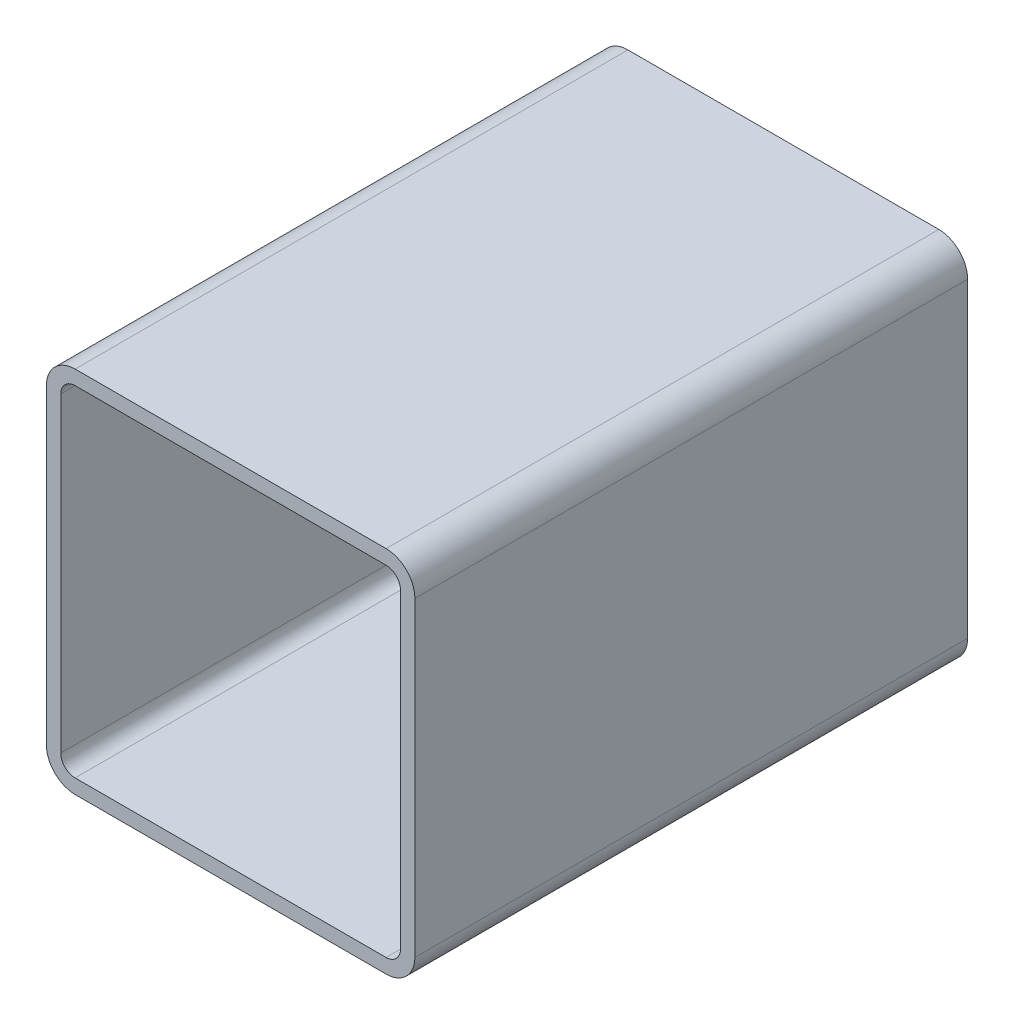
ISO-10303-21;
HEADER;
FILE_DESCRIPTION(('STEP AP214'),'2;1');
FILE_NAME('part.step','',(''),(''),'','','');
FILE_SCHEMA(('AUTOMOTIVE_DESIGN { 1 0 10303 214 1 1 1 1 }'));
ENDSEC;
DATA;
#1=APPLICATION_CONTEXT('core data for automotive mechanical design processes');
#2=APPLICATION_PROTOCOL_DEFINITION('international standard','automotive_design',2000,#1);
#3=PRODUCT_CONTEXT('',#1,'mechanical');
#4=PRODUCT('Part','Part','',(#3));
#5=PRODUCT_RELATED_PRODUCT_CATEGORY('part','',(#4));
#6=PRODUCT_DEFINITION_FORMATION('','',#4);
#7=PRODUCT_DEFINITION_CONTEXT('part definition',#1,'design');
#8=PRODUCT_DEFINITION('design','',#6,#7);
#9=PRODUCT_DEFINITION_SHAPE('','',#8);
#10=(LENGTH_UNIT() NAMED_UNIT(*) SI_UNIT(.MILLI.,.METRE.));
#11=(NAMED_UNIT(*) PLANE_ANGLE_UNIT() SI_UNIT($,.RADIAN.));
#12=(NAMED_UNIT(*) SI_UNIT($,.STERADIAN.) SOLID_ANGLE_UNIT());
#13=UNCERTAINTY_MEASURE_WITH_UNIT(LENGTH_MEASURE(1.E-05),#10,'distance_accuracy_value','');
#14=(GEOMETRIC_REPRESENTATION_CONTEXT(3) GLOBAL_UNCERTAINTY_ASSIGNED_CONTEXT((#13)) GLOBAL_UNIT_ASSIGNED_CONTEXT((#10,
#11,#12)) REPRESENTATION_CONTEXT('',''));
#15=CARTESIAN_POINT('',(0.,0.,0.));
#16=DIRECTION('',(0.,0.,1.));
#17=DIRECTION('',(1.,0.,0.));
#18=AXIS2_PLACEMENT_3D('',#15,#16,#17);
#19=CARTESIAN_POINT('',(17.2659404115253,189.291130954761,304.8));
#20=DIRECTION('',(0.,0.,1.));
#21=DIRECTION('',(1.,0.,0.));
#22=AXIS2_PLACEMENT_3D('',#19,#20,#21);
#23=PLANE('',#22);
#24=CARTESIAN_POINT('',(17.2659404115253,189.291130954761,304.8));
#25=DIRECTION('',(0.,0.,1.));
#26=DIRECTION('',(1.,0.,0.));
#27=AXIS2_PLACEMENT_3D('',#24,#25,#26);
#28=CIRCLE('',#27,15.875);
#29=CARTESIAN_POINT('',(17.2659404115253,205.166130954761,304.8));
#30=VERTEX_POINT('',#29);
#31=CARTESIAN_POINT('',(1.3909404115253,189.291130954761,304.8));
#32=VERTEX_POINT('',#31);
#33=EDGE_CURVE('E211',#30,#32,#28,.T.);
#34=ORIENTED_EDGE('',*,*,#33,.T.);
#35=DIRECTION('',(0.,-1.,0.));
#36=VECTOR('',#35,1.);
#37=CARTESIAN_POINT('',(1.3909404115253,17.8411309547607,304.8));
#38=LINE('',#37,#36);
#39=CARTESIAN_POINT('',(1.3909404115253,17.8411309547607,304.8));
#40=VERTEX_POINT('',#39);
#41=EDGE_CURVE('E214',#32,#40,#38,.T.);
#42=ORIENTED_EDGE('',*,*,#41,.T.);
#43=CARTESIAN_POINT('',(17.2659404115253,17.8411309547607,304.8));
#44=DIRECTION('',(0.,0.,1.));
#45=DIRECTION('',(1.,0.,0.));
#46=AXIS2_PLACEMENT_3D('',#43,#44,#45);
#47=CIRCLE('',#46,15.875);
#48=CARTESIAN_POINT('',(17.2659404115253,1.96613095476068,304.8));
#49=VERTEX_POINT('',#48);
#50=EDGE_CURVE('E217',#40,#49,#47,.T.);
#51=ORIENTED_EDGE('',*,*,#50,.T.);
#52=DIRECTION('',(1.,0.,0.));
#53=VECTOR('',#52,1.);
#54=CARTESIAN_POINT('',(188.715940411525,1.96613095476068,304.8));
#55=LINE('',#54,#53);
#56=CARTESIAN_POINT('',(188.715940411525,1.96613095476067,304.8));
#57=VERTEX_POINT('',#56);
#58=EDGE_CURVE('E219',#49,#57,#55,.T.);
#59=ORIENTED_EDGE('',*,*,#58,.T.);
#60=CARTESIAN_POINT('',(188.715940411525,17.8411309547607,304.8));
#61=DIRECTION('',(0.,0.,1.));
#62=DIRECTION('',(1.,0.,0.));
#63=AXIS2_PLACEMENT_3D('',#60,#61,#62);
#64=CIRCLE('',#63,15.875);
#65=CARTESIAN_POINT('',(204.590940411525,17.8411309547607,304.8));
#66=VERTEX_POINT('',#65);
#67=EDGE_CURVE('E221',#57,#66,#64,.T.);
#68=ORIENTED_EDGE('',*,*,#67,.T.);
#69=DIRECTION('',(0.,1.,0.));
#70=VECTOR('',#69,1.);
#71=CARTESIAN_POINT('',(204.590940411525,189.291130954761,304.8));
#72=LINE('',#71,#70);
#73=CARTESIAN_POINT('',(204.590940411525,189.291130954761,304.8));
#74=VERTEX_POINT('',#73);
#75=EDGE_CURVE('E223',#66,#74,#72,.T.);
#76=ORIENTED_EDGE('',*,*,#75,.T.);
#77=CARTESIAN_POINT('',(188.715940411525,189.291130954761,304.8));
#78=DIRECTION('',(0.,0.,1.));
#79=DIRECTION('',(1.,0.,0.));
#80=AXIS2_PLACEMENT_3D('',#77,#78,#79);
#81=CIRCLE('',#80,15.875);
#82=CARTESIAN_POINT('',(188.715940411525,205.166130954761,304.8));
#83=VERTEX_POINT('',#82);
#84=EDGE_CURVE('E225',#74,#83,#81,.T.);
#85=ORIENTED_EDGE('',*,*,#84,.T.);
#86=DIRECTION('',(-1.,0.,0.));
#87=VECTOR('',#86,1.);
#88=CARTESIAN_POINT('',(17.2659404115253,205.166130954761,304.8));
#89=LINE('',#88,#87);
#90=EDGE_CURVE('E227',#83,#30,#89,.T.);
#91=ORIENTED_EDGE('',*,*,#90,.T.);
#92=EDGE_LOOP('',(#34,#42,#51,#59,#68,#76,#85,#91));
#93=FACE_BOUND('',#92,.T.);
#94=DIRECTION('',(0.,-1.,0.));
#95=VECTOR('',#94,1.);
#96=CARTESIAN_POINT('',(9.3284404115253,17.8411309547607,304.8));
#97=LINE('',#96,#95);
#98=CARTESIAN_POINT('',(9.3284404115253,189.291130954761,304.8));
#99=VERTEX_POINT('',#98);
#100=CARTESIAN_POINT('',(9.3284404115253,17.8411309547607,304.8));
#101=VERTEX_POINT('',#100);
#102=EDGE_CURVE('E154',#99,#101,#97,.T.);
#103=ORIENTED_EDGE('',*,*,#102,.F.);
#104=CARTESIAN_POINT('',(17.2659404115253,189.291130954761,304.8));
#105=DIRECTION('',(0.,0.,1.));
#106=DIRECTION('',(1.,0.,0.));
#107=AXIS2_PLACEMENT_3D('',#104,#105,#106);
#108=CIRCLE('',#107,7.9375);
#109=CARTESIAN_POINT('',(17.2659404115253,197.228630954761,304.8));
#110=VERTEX_POINT('',#109);
#111=EDGE_CURVE('E146',#110,#99,#108,.T.);
#112=ORIENTED_EDGE('',*,*,#111,.F.);
#113=DIRECTION('',(-1.,0.,0.));
#114=VECTOR('',#113,1.);
#115=CARTESIAN_POINT('',(17.2659404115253,197.228630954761,304.8));
#116=LINE('',#115,#114);
#117=CARTESIAN_POINT('',(188.715940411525,197.228630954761,304.8));
#118=VERTEX_POINT('',#117);
#119=EDGE_CURVE('E179',#118,#110,#116,.T.);
#120=ORIENTED_EDGE('',*,*,#119,.F.);
#121=CARTESIAN_POINT('',(188.715940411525,189.291130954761,304.8));
#122=DIRECTION('',(0.,0.,1.));
#123=DIRECTION('',(1.,0.,0.));
#124=AXIS2_PLACEMENT_3D('',#121,#122,#123);
#125=CIRCLE('',#124,7.93750000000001);
#126=CARTESIAN_POINT('',(196.653440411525,189.291130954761,304.8));
#127=VERTEX_POINT('',#126);
#128=EDGE_CURVE('E177',#127,#118,#125,.T.);
#129=ORIENTED_EDGE('',*,*,#128,.F.);
#130=DIRECTION('',(0.,1.,0.));
#131=VECTOR('',#130,1.);
#132=CARTESIAN_POINT('',(196.653440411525,189.291130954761,304.8));
#133=LINE('',#132,#131);
#134=CARTESIAN_POINT('',(196.653440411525,17.8411309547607,304.8));
#135=VERTEX_POINT('',#134);
#136=EDGE_CURVE('E175',#135,#127,#133,.T.);
#137=ORIENTED_EDGE('',*,*,#136,.F.);
#138=CARTESIAN_POINT('',(188.715940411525,17.8411309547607,304.8));
#139=DIRECTION('',(0.,0.,1.));
#140=DIRECTION('',(1.,0.,0.));
#141=AXIS2_PLACEMENT_3D('',#138,#139,#140);
#142=CIRCLE('',#141,7.93750000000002);
#143=CARTESIAN_POINT('',(188.715940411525,9.90363095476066,304.8));
#144=VERTEX_POINT('',#143);
#145=EDGE_CURVE('E173',#144,#135,#142,.T.);
#146=ORIENTED_EDGE('',*,*,#145,.F.);
#147=DIRECTION('',(1.,0.,0.));
#148=VECTOR('',#147,1.);
#149=CARTESIAN_POINT('',(188.715940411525,9.90363095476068,304.8));
#150=LINE('',#149,#148);
#151=CARTESIAN_POINT('',(17.2659404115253,9.90363095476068,304.8));
#152=VERTEX_POINT('',#151);
#153=EDGE_CURVE('E169',#152,#144,#150,.T.);
#154=ORIENTED_EDGE('',*,*,#153,.F.);
#155=CARTESIAN_POINT('',(17.2659404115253,17.8411309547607,304.8));
#156=DIRECTION('',(0.,0.,1.));
#157=DIRECTION('',(1.,0.,0.));
#158=AXIS2_PLACEMENT_3D('',#155,#156,#157);
#159=CIRCLE('',#158,7.9375);
#160=EDGE_CURVE('E167',#101,#152,#159,.T.);
#161=ORIENTED_EDGE('',*,*,#160,.F.);
#162=EDGE_LOOP('',(#103,#112,#120,#129,#137,#146,#154,#161));
#163=FACE_BOUND('',#162,.T.);
#164=ADVANCED_FACE('F33',(#93,#163),#23,.T.);
#165=CARTESIAN_POINT('',(17.2659404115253,189.291130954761,0.));
#166=DIRECTION('',(0.,0.,1.));
#167=DIRECTION('',(1.,0.,0.));
#168=AXIS2_PLACEMENT_3D('',#165,#166,#167);
#169=PLANE('',#168);
#170=CARTESIAN_POINT('',(17.2659404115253,189.291130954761,0.));
#171=DIRECTION('',(0.,0.,1.));
#172=DIRECTION('',(1.,0.,0.));
#173=AXIS2_PLACEMENT_3D('',#170,#171,#172);
#174=CIRCLE('',#173,15.875);
#175=CARTESIAN_POINT('',(17.2659404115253,205.166130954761,0.));
#176=VERTEX_POINT('',#175);
#177=CARTESIAN_POINT('',(1.3909404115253,189.291130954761,0.));
#178=VERTEX_POINT('',#177);
#179=EDGE_CURVE('E162',#176,#178,#174,.T.);
#180=ORIENTED_EDGE('',*,*,#179,.F.);
#181=DIRECTION('',(-1.,0.,0.));
#182=VECTOR('',#181,1.);
#183=CARTESIAN_POINT('',(17.2659404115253,205.166130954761,0.));
#184=LINE('',#183,#182);
#185=CARTESIAN_POINT('',(188.715940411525,205.166130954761,0.));
#186=VERTEX_POINT('',#185);
#187=EDGE_CURVE('E215',#186,#176,#184,.T.);
#188=ORIENTED_EDGE('',*,*,#187,.F.);
#189=CARTESIAN_POINT('',(188.715940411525,189.291130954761,0.));
#190=DIRECTION('',(0.,0.,1.));
#191=DIRECTION('',(1.,0.,0.));
#192=AXIS2_PLACEMENT_3D('',#189,#190,#191);
#193=CIRCLE('',#192,15.875);
#194=CARTESIAN_POINT('',(204.590940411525,189.291130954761,0.));
#195=VERTEX_POINT('',#194);
#196=EDGE_CURVE('E242',#195,#186,#193,.T.);
#197=ORIENTED_EDGE('',*,*,#196,.F.);
#198=DIRECTION('',(0.,1.,0.));
#199=VECTOR('',#198,1.);
#200=CARTESIAN_POINT('',(204.590940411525,189.291130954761,0.));
#201=LINE('',#200,#199);
#202=CARTESIAN_POINT('',(204.590940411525,17.8411309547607,0.));
#203=VERTEX_POINT('',#202);
#204=EDGE_CURVE('E240',#203,#195,#201,.T.);
#205=ORIENTED_EDGE('',*,*,#204,.F.);
#206=CARTESIAN_POINT('',(188.715940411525,17.8411309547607,0.));
#207=DIRECTION('',(0.,0.,1.));
#208=DIRECTION('',(1.,0.,0.));
#209=AXIS2_PLACEMENT_3D('',#206,#207,#208);
#210=CIRCLE('',#209,15.875);
#211=CARTESIAN_POINT('',(188.715940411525,1.96613095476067,0.));
#212=VERTEX_POINT('',#211);
#213=EDGE_CURVE('E238',#212,#203,#210,.T.);
#214=ORIENTED_EDGE('',*,*,#213,.F.);
#215=DIRECTION('',(1.,0.,0.));
#216=VECTOR('',#215,1.);
#217=CARTESIAN_POINT('',(188.715940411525,1.96613095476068,0.));
#218=LINE('',#217,#216);
#219=CARTESIAN_POINT('',(17.2659404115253,1.96613095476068,0.));
#220=VERTEX_POINT('',#219);
#221=EDGE_CURVE('E236',#220,#212,#218,.T.);
#222=ORIENTED_EDGE('',*,*,#221,.F.);
#223=CARTESIAN_POINT('',(17.2659404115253,17.8411309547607,0.));
#224=DIRECTION('',(0.,0.,1.));
#225=DIRECTION('',(1.,0.,0.));
#226=AXIS2_PLACEMENT_3D('',#223,#224,#225);
#227=CIRCLE('',#226,15.875);
#228=CARTESIAN_POINT('',(1.3909404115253,17.8411309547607,0.));
#229=VERTEX_POINT('',#228);
#230=EDGE_CURVE('E234',#229,#220,#227,.T.);
#231=ORIENTED_EDGE('',*,*,#230,.F.);
#232=DIRECTION('',(0.,-1.,0.));
#233=VECTOR('',#232,1.);
#234=CARTESIAN_POINT('',(1.3909404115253,17.8411309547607,0.));
#235=LINE('',#234,#233);
#236=EDGE_CURVE('E232',#178,#229,#235,.T.);
#237=ORIENTED_EDGE('',*,*,#236,.F.);
#238=EDGE_LOOP('',(#180,#188,#197,#205,#214,#222,#231,#237));
#239=FACE_BOUND('',#238,.T.);
#240=CARTESIAN_POINT('',(17.2659404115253,189.291130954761,0.));
#241=DIRECTION('',(0.,0.,1.));
#242=DIRECTION('',(1.,0.,0.));
#243=AXIS2_PLACEMENT_3D('',#240,#241,#242);
#244=CIRCLE('',#243,7.9375);
#245=CARTESIAN_POINT('',(17.2659404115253,197.228630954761,0.));
#246=VERTEX_POINT('',#245);
#247=CARTESIAN_POINT('',(9.3284404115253,189.291130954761,0.));
#248=VERTEX_POINT('',#247);
#249=EDGE_CURVE('E56',#246,#248,#244,.T.);
#250=ORIENTED_EDGE('',*,*,#249,.T.);
#251=DIRECTION('',(0.,-1.,0.));
#252=VECTOR('',#251,1.);
#253=CARTESIAN_POINT('',(9.3284404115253,17.8411309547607,0.));
#254=LINE('',#253,#252);
#255=CARTESIAN_POINT('',(9.3284404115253,17.8411309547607,0.));
#256=VERTEX_POINT('',#255);
#257=EDGE_CURVE('E161',#248,#256,#254,.T.);
#258=ORIENTED_EDGE('',*,*,#257,.T.);
#259=CARTESIAN_POINT('',(17.2659404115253,17.8411309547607,0.));
#260=DIRECTION('',(0.,0.,1.));
#261=DIRECTION('',(1.,0.,0.));
#262=AXIS2_PLACEMENT_3D('',#259,#260,#261);
#263=CIRCLE('',#262,7.9375);
#264=CARTESIAN_POINT('',(17.2659404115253,9.90363095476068,0.));
#265=VERTEX_POINT('',#264);
#266=EDGE_CURVE('E183',#256,#265,#263,.T.);
#267=ORIENTED_EDGE('',*,*,#266,.T.);
#268=DIRECTION('',(1.,0.,0.));
#269=VECTOR('',#268,1.);
#270=CARTESIAN_POINT('',(188.715940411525,9.90363095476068,0.));
#271=LINE('',#270,#269);
#272=CARTESIAN_POINT('',(188.715940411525,9.90363095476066,0.));
#273=VERTEX_POINT('',#272);
#274=EDGE_CURVE('E186',#265,#273,#271,.T.);
#275=ORIENTED_EDGE('',*,*,#274,.T.);
#276=CARTESIAN_POINT('',(188.715940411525,17.8411309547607,0.));
#277=DIRECTION('',(0.,0.,1.));
#278=DIRECTION('',(1.,0.,0.));
#279=AXIS2_PLACEMENT_3D('',#276,#277,#278);
#280=CIRCLE('',#279,7.93750000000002);
#281=CARTESIAN_POINT('',(196.653440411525,17.8411309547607,0.));
#282=VERTEX_POINT('',#281);
#283=EDGE_CURVE('E189',#273,#282,#280,.T.);
#284=ORIENTED_EDGE('',*,*,#283,.T.);
#285=DIRECTION('',(0.,1.,0.));
#286=VECTOR('',#285,1.);
#287=CARTESIAN_POINT('',(196.653440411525,189.291130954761,0.));
#288=LINE('',#287,#286);
#289=CARTESIAN_POINT('',(196.653440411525,189.291130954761,0.));
#290=VERTEX_POINT('',#289);
#291=EDGE_CURVE('E192',#282,#290,#288,.T.);
#292=ORIENTED_EDGE('',*,*,#291,.T.);
#293=CARTESIAN_POINT('',(188.715940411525,189.291130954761,0.));
#294=DIRECTION('',(0.,0.,1.));
#295=DIRECTION('',(1.,0.,0.));
#296=AXIS2_PLACEMENT_3D('',#293,#294,#295);
#297=CIRCLE('',#296,7.93750000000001);
#298=CARTESIAN_POINT('',(188.715940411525,197.228630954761,0.));
#299=VERTEX_POINT('',#298);
#300=EDGE_CURVE('E195',#290,#299,#297,.T.);
#301=ORIENTED_EDGE('',*,*,#300,.T.);
#302=DIRECTION('',(-1.,0.,0.));
#303=VECTOR('',#302,1.);
#304=CARTESIAN_POINT('',(17.2659404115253,197.228630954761,0.));
#305=LINE('',#304,#303);
#306=EDGE_CURVE('E155',#299,#246,#305,.T.);
#307=ORIENTED_EDGE('',*,*,#306,.T.);
#308=EDGE_LOOP('',(#250,#258,#267,#275,#284,#292,#301,#307));
#309=FACE_BOUND('',#308,.T.);
#310=ADVANCED_FACE('F272',(#239,#309),#169,.F.);
#311=CARTESIAN_POINT('',(17.2659404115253,189.291130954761,304.8));
#312=DIRECTION('',(0.,0.,-1.));
#313=DIRECTION('',(-1.,0.,0.));
#314=AXIS2_PLACEMENT_3D('',#311,#312,#313);
#315=CYLINDRICAL_SURFACE('',#314,15.875);
#316=ORIENTED_EDGE('',*,*,#179,.T.);
#317=DIRECTION('',(0.,0.,-1.));
#318=VECTOR('',#317,1.);
#319=CARTESIAN_POINT('',(1.3909404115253,189.291130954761,304.8));
#320=LINE('',#319,#318);
#321=EDGE_CURVE('E11',#32,#178,#320,.T.);
#322=ORIENTED_EDGE('',*,*,#321,.F.);
#323=ORIENTED_EDGE('',*,*,#33,.F.);
#324=DIRECTION('',(0.,0.,-1.));
#325=VECTOR('',#324,1.);
#326=CARTESIAN_POINT('',(17.2659404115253,205.166130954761,304.8));
#327=LINE('',#326,#325);
#328=EDGE_CURVE('E229',#30,#176,#327,.T.);
#329=ORIENTED_EDGE('',*,*,#328,.T.);
#330=EDGE_LOOP('',(#316,#322,#323,#329));
#331=FACE_BOUND('',#330,.T.);
#332=ADVANCED_FACE('F35',(#331),#315,.T.);
#333=CARTESIAN_POINT('',(1.3909404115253,17.8411309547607,304.8));
#334=DIRECTION('',(1.,0.,0.));
#335=DIRECTION('',(0.,0.,-1.));
#336=AXIS2_PLACEMENT_3D('',#333,#334,#335);
#337=PLANE('',#336);
#338=ORIENTED_EDGE('',*,*,#236,.T.);
#339=DIRECTION('',(0.,0.,-1.));
#340=VECTOR('',#339,1.);
#341=CARTESIAN_POINT('',(1.3909404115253,17.8411309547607,304.8));
#342=LINE('',#341,#340);
#343=EDGE_CURVE('E41',#40,#229,#342,.T.);
#344=ORIENTED_EDGE('',*,*,#343,.F.);
#345=ORIENTED_EDGE('',*,*,#41,.F.);
#346=ORIENTED_EDGE('',*,*,#321,.T.);
#347=EDGE_LOOP('',(#338,#344,#345,#346));
#348=FACE_BOUND('',#347,.T.);
#349=ADVANCED_FACE('F289',(#348),#337,.F.);
#350=CARTESIAN_POINT('',(17.2659404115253,17.8411309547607,304.8));
#351=DIRECTION('',(0.,0.,-1.));
#352=DIRECTION('',(-1.,0.,0.));
#353=AXIS2_PLACEMENT_3D('',#350,#351,#352);
#354=CYLINDRICAL_SURFACE('',#353,15.875);
#355=ORIENTED_EDGE('',*,*,#230,.T.);
#356=DIRECTION('',(0.,0.,-1.));
#357=VECTOR('',#356,1.);
#358=CARTESIAN_POINT('',(17.2659404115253,1.96613095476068,304.8));
#359=LINE('',#358,#357);
#360=EDGE_CURVE('E259',#49,#220,#359,.T.);
#361=ORIENTED_EDGE('',*,*,#360,.F.);
#362=ORIENTED_EDGE('',*,*,#50,.F.);
#363=ORIENTED_EDGE('',*,*,#343,.T.);
#364=EDGE_LOOP('',(#355,#361,#362,#363));
#365=FACE_BOUND('',#364,.T.);
#366=ADVANCED_FACE('F266',(#365),#354,.T.);
#367=CARTESIAN_POINT('',(188.715940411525,1.96613095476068,304.8));
#368=DIRECTION('',(0.,1.,0.));
#369=DIRECTION('',(0.,0.,1.));
#370=AXIS2_PLACEMENT_3D('',#367,#368,#369);
#371=PLANE('',#370);
#372=ORIENTED_EDGE('',*,*,#221,.T.);
#373=DIRECTION('',(0.,0.,-1.));
#374=VECTOR('',#373,1.);
#375=CARTESIAN_POINT('',(188.715940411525,1.96613095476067,304.8));
#376=LINE('',#375,#374);
#377=EDGE_CURVE('E256',#57,#212,#376,.T.);
#378=ORIENTED_EDGE('',*,*,#377,.F.);
#379=ORIENTED_EDGE('',*,*,#58,.F.);
#380=ORIENTED_EDGE('',*,*,#360,.T.);
#381=EDGE_LOOP('',(#372,#378,#379,#380));
#382=FACE_BOUND('',#381,.T.);
#383=ADVANCED_FACE('F278',(#382),#371,.F.);
#384=CARTESIAN_POINT('',(188.715940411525,17.8411309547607,304.8));
#385=DIRECTION('',(0.,0.,-1.));
#386=DIRECTION('',(-1.,0.,0.));
#387=AXIS2_PLACEMENT_3D('',#384,#385,#386);
#388=CYLINDRICAL_SURFACE('',#387,15.875);
#389=ORIENTED_EDGE('',*,*,#213,.T.);
#390=DIRECTION('',(0.,0.,-1.));
#391=VECTOR('',#390,1.);
#392=CARTESIAN_POINT('',(204.590940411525,17.8411309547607,304.8));
#393=LINE('',#392,#391);
#394=EDGE_CURVE('E253',#66,#203,#393,.T.);
#395=ORIENTED_EDGE('',*,*,#394,.F.);
#396=ORIENTED_EDGE('',*,*,#67,.F.);
#397=ORIENTED_EDGE('',*,*,#377,.T.);
#398=EDGE_LOOP('',(#389,#395,#396,#397));
#399=FACE_BOUND('',#398,.T.);
#400=ADVANCED_FACE('F282',(#399),#388,.T.);
#401=CARTESIAN_POINT('',(204.590940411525,189.291130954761,304.8));
#402=DIRECTION('',(-1.,0.,0.));
#403=DIRECTION('',(0.,0.,1.));
#404=AXIS2_PLACEMENT_3D('',#401,#402,#403);
#405=PLANE('',#404);
#406=ORIENTED_EDGE('',*,*,#204,.T.);
#407=DIRECTION('',(0.,0.,-1.));
#408=VECTOR('',#407,1.);
#409=CARTESIAN_POINT('',(204.590940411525,189.291130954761,304.8));
#410=LINE('',#409,#408);
#411=EDGE_CURVE('E250',#74,#195,#410,.T.);
#412=ORIENTED_EDGE('',*,*,#411,.F.);
#413=ORIENTED_EDGE('',*,*,#75,.F.);
#414=ORIENTED_EDGE('',*,*,#394,.T.);
#415=EDGE_LOOP('',(#406,#412,#413,#414));
#416=FACE_BOUND('',#415,.T.);
#417=ADVANCED_FACE('F302',(#416),#405,.F.);
#418=CARTESIAN_POINT('',(188.715940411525,189.291130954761,304.8));
#419=DIRECTION('',(0.,0.,-1.));
#420=DIRECTION('',(-1.,0.,0.));
#421=AXIS2_PLACEMENT_3D('',#418,#419,#420);
#422=CYLINDRICAL_SURFACE('',#421,15.875);
#423=ORIENTED_EDGE('',*,*,#196,.T.);
#424=DIRECTION('',(0.,0.,-1.));
#425=VECTOR('',#424,1.);
#426=CARTESIAN_POINT('',(188.715940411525,205.166130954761,304.8));
#427=LINE('',#426,#425);
#428=EDGE_CURVE('E247',#83,#186,#427,.T.);
#429=ORIENTED_EDGE('',*,*,#428,.F.);
#430=ORIENTED_EDGE('',*,*,#84,.F.);
#431=ORIENTED_EDGE('',*,*,#411,.T.);
#432=EDGE_LOOP('',(#423,#429,#430,#431));
#433=FACE_BOUND('',#432,.T.);
#434=ADVANCED_FACE('F300',(#433),#422,.T.);
#435=CARTESIAN_POINT('',(17.2659404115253,205.166130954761,304.8));
#436=DIRECTION('',(0.,-1.,0.));
#437=DIRECTION('',(0.,0.,-1.));
#438=AXIS2_PLACEMENT_3D('',#435,#436,#437);
#439=PLANE('',#438);
#440=ORIENTED_EDGE('',*,*,#187,.T.);
#441=ORIENTED_EDGE('',*,*,#328,.F.);
#442=ORIENTED_EDGE('',*,*,#90,.F.);
#443=ORIENTED_EDGE('',*,*,#428,.T.);
#444=EDGE_LOOP('',(#440,#441,#442,#443));
#445=FACE_BOUND('',#444,.T.);
#446=ADVANCED_FACE('F295',(#445),#439,.F.);
#447=CARTESIAN_POINT('',(17.2659404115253,189.291130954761,304.8));
#448=DIRECTION('',(0.,0.,-1.));
#449=DIRECTION('',(-1.,0.,0.));
#450=AXIS2_PLACEMENT_3D('',#447,#448,#449);
#451=CYLINDRICAL_SURFACE('',#450,7.9375);
#452=ORIENTED_EDGE('',*,*,#249,.F.);
#453=DIRECTION('',(0.,0.,-1.));
#454=VECTOR('',#453,1.);
#455=CARTESIAN_POINT('',(17.2659404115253,197.228630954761,304.8));
#456=LINE('',#455,#454);
#457=EDGE_CURVE('E150',#110,#246,#456,.T.);
#458=ORIENTED_EDGE('',*,*,#457,.F.);
#459=ORIENTED_EDGE('',*,*,#111,.T.);
#460=DIRECTION('',(0.,0.,-1.));
#461=VECTOR('',#460,1.);
#462=CARTESIAN_POINT('',(9.3284404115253,189.291130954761,304.8));
#463=LINE('',#462,#461);
#464=EDGE_CURVE('E149',#99,#248,#463,.T.);
#465=ORIENTED_EDGE('',*,*,#464,.T.);
#466=EDGE_LOOP('',(#452,#458,#459,#465));
#467=FACE_BOUND('',#466,.T.);
#468=ADVANCED_FACE('F148',(#467),#451,.F.);
#469=CARTESIAN_POINT('',(9.3284404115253,17.8411309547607,304.8));
#470=DIRECTION('',(1.,0.,0.));
#471=DIRECTION('',(0.,0.,-1.));
#472=AXIS2_PLACEMENT_3D('',#469,#470,#471);
#473=PLANE('',#472);
#474=ORIENTED_EDGE('',*,*,#257,.F.);
#475=ORIENTED_EDGE('',*,*,#464,.F.);
#476=ORIENTED_EDGE('',*,*,#102,.T.);
#477=DIRECTION('',(0.,0.,-1.));
#478=VECTOR('',#477,1.);
#479=CARTESIAN_POINT('',(9.3284404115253,17.8411309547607,304.8));
#480=LINE('',#479,#478);
#481=EDGE_CURVE('E163',#101,#256,#480,.T.);
#482=ORIENTED_EDGE('',*,*,#481,.T.);
#483=EDGE_LOOP('',(#474,#475,#476,#482));
#484=FACE_BOUND('',#483,.T.);
#485=ADVANCED_FACE('F158',(#484),#473,.T.);
#486=CARTESIAN_POINT('',(17.2659404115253,17.8411309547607,304.8));
#487=DIRECTION('',(0.,0.,-1.));
#488=DIRECTION('',(-1.,0.,0.));
#489=AXIS2_PLACEMENT_3D('',#486,#487,#488);
#490=CYLINDRICAL_SURFACE('',#489,7.9375);
#491=ORIENTED_EDGE('',*,*,#266,.F.);
#492=ORIENTED_EDGE('',*,*,#481,.F.);
#493=ORIENTED_EDGE('',*,*,#160,.T.);
#494=DIRECTION('',(0.,0.,-1.));
#495=VECTOR('',#494,1.);
#496=CARTESIAN_POINT('',(17.2659404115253,9.90363095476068,304.8));
#497=LINE('',#496,#495);
#498=EDGE_CURVE('E208',#152,#265,#497,.T.);
#499=ORIENTED_EDGE('',*,*,#498,.T.);
#500=EDGE_LOOP('',(#491,#492,#493,#499));
#501=FACE_BOUND('',#500,.T.);
#502=ADVANCED_FACE('F327',(#501),#490,.F.);
#503=CARTESIAN_POINT('',(188.715940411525,9.90363095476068,304.8));
#504=DIRECTION('',(0.,1.,0.));
#505=DIRECTION('',(0.,0.,1.));
#506=AXIS2_PLACEMENT_3D('',#503,#504,#505);
#507=PLANE('',#506);
#508=ORIENTED_EDGE('',*,*,#274,.F.);
#509=ORIENTED_EDGE('',*,*,#498,.F.);
#510=ORIENTED_EDGE('',*,*,#153,.T.);
#511=DIRECTION('',(0.,0.,-1.));
#512=VECTOR('',#511,1.);
#513=CARTESIAN_POINT('',(188.715940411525,9.90363095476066,304.8));
#514=LINE('',#513,#512);
#515=EDGE_CURVE('E206',#144,#273,#514,.T.);
#516=ORIENTED_EDGE('',*,*,#515,.T.);
#517=EDGE_LOOP('',(#508,#509,#510,#516));
#518=FACE_BOUND('',#517,.T.);
#519=ADVANCED_FACE('F331',(#518),#507,.T.);
#520=CARTESIAN_POINT('',(188.715940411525,17.8411309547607,304.8));
#521=DIRECTION('',(0.,0.,-1.));
#522=DIRECTION('',(-1.,0.,0.));
#523=AXIS2_PLACEMENT_3D('',#520,#521,#522);
#524=CYLINDRICAL_SURFACE('',#523,7.93750000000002);
#525=ORIENTED_EDGE('',*,*,#283,.F.);
#526=ORIENTED_EDGE('',*,*,#515,.F.);
#527=ORIENTED_EDGE('',*,*,#145,.T.);
#528=DIRECTION('',(0.,0.,-1.));
#529=VECTOR('',#528,1.);
#530=CARTESIAN_POINT('',(196.653440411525,17.8411309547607,304.8));
#531=LINE('',#530,#529);
#532=EDGE_CURVE('E204',#135,#282,#531,.T.);
#533=ORIENTED_EDGE('',*,*,#532,.T.);
#534=EDGE_LOOP('',(#525,#526,#527,#533));
#535=FACE_BOUND('',#534,.T.);
#536=ADVANCED_FACE('F337',(#535),#524,.F.);
#537=CARTESIAN_POINT('',(196.653440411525,189.291130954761,304.8));
#538=DIRECTION('',(-1.,0.,0.));
#539=DIRECTION('',(0.,0.,1.));
#540=AXIS2_PLACEMENT_3D('',#537,#538,#539);
#541=PLANE('',#540);
#542=ORIENTED_EDGE('',*,*,#291,.F.);
#543=ORIENTED_EDGE('',*,*,#532,.F.);
#544=ORIENTED_EDGE('',*,*,#136,.T.);
#545=DIRECTION('',(0.,0.,-1.));
#546=VECTOR('',#545,1.);
#547=CARTESIAN_POINT('',(196.653440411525,189.291130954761,304.8));
#548=LINE('',#547,#546);
#549=EDGE_CURVE('E202',#127,#290,#548,.T.);
#550=ORIENTED_EDGE('',*,*,#549,.T.);
#551=EDGE_LOOP('',(#542,#543,#544,#550));
#552=FACE_BOUND('',#551,.T.);
#553=ADVANCED_FACE('F341',(#552),#541,.T.);
#554=CARTESIAN_POINT('',(188.715940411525,189.291130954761,304.8));
#555=DIRECTION('',(0.,0.,-1.));
#556=DIRECTION('',(-1.,0.,0.));
#557=AXIS2_PLACEMENT_3D('',#554,#555,#556);
#558=CYLINDRICAL_SURFACE('',#557,7.93750000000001);
#559=ORIENTED_EDGE('',*,*,#300,.F.);
#560=ORIENTED_EDGE('',*,*,#549,.F.);
#561=ORIENTED_EDGE('',*,*,#128,.T.);
#562=DIRECTION('',(0.,0.,-1.));
#563=VECTOR('',#562,1.);
#564=CARTESIAN_POINT('',(188.715940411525,197.228630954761,304.8));
#565=LINE('',#564,#563);
#566=EDGE_CURVE('E48',#118,#299,#565,.T.);
#567=ORIENTED_EDGE('',*,*,#566,.T.);
#568=EDGE_LOOP('',(#559,#560,#561,#567));
#569=FACE_BOUND('',#568,.T.);
#570=ADVANCED_FACE('F345',(#569),#558,.F.);
#571=CARTESIAN_POINT('',(17.2659404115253,197.228630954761,304.8));
#572=DIRECTION('',(0.,-1.,0.));
#573=DIRECTION('',(0.,0.,-1.));
#574=AXIS2_PLACEMENT_3D('',#571,#572,#573);
#575=PLANE('',#574);
#576=ORIENTED_EDGE('',*,*,#306,.F.);
#577=ORIENTED_EDGE('',*,*,#566,.F.);
#578=ORIENTED_EDGE('',*,*,#119,.T.);
#579=ORIENTED_EDGE('',*,*,#457,.T.);
#580=EDGE_LOOP('',(#576,#577,#578,#579));
#581=FACE_BOUND('',#580,.T.);
#582=ADVANCED_FACE('F349',(#581),#575,.T.);
#583=CLOSED_SHELL('',(#164,#310,#332,#349,#366,#383,#400,#417,#434,#446,#468,#485,#502,#519,
#536,#553,#570,#582));
#584=MANIFOLD_SOLID_BREP('B2',#583);
#585=ADVANCED_BREP_SHAPE_REPRESENTATION('',(#18,#584),#14);
#586=SHAPE_DEFINITION_REPRESENTATION(#9,#585);
ENDSEC;
END-ISO-10303-21;
